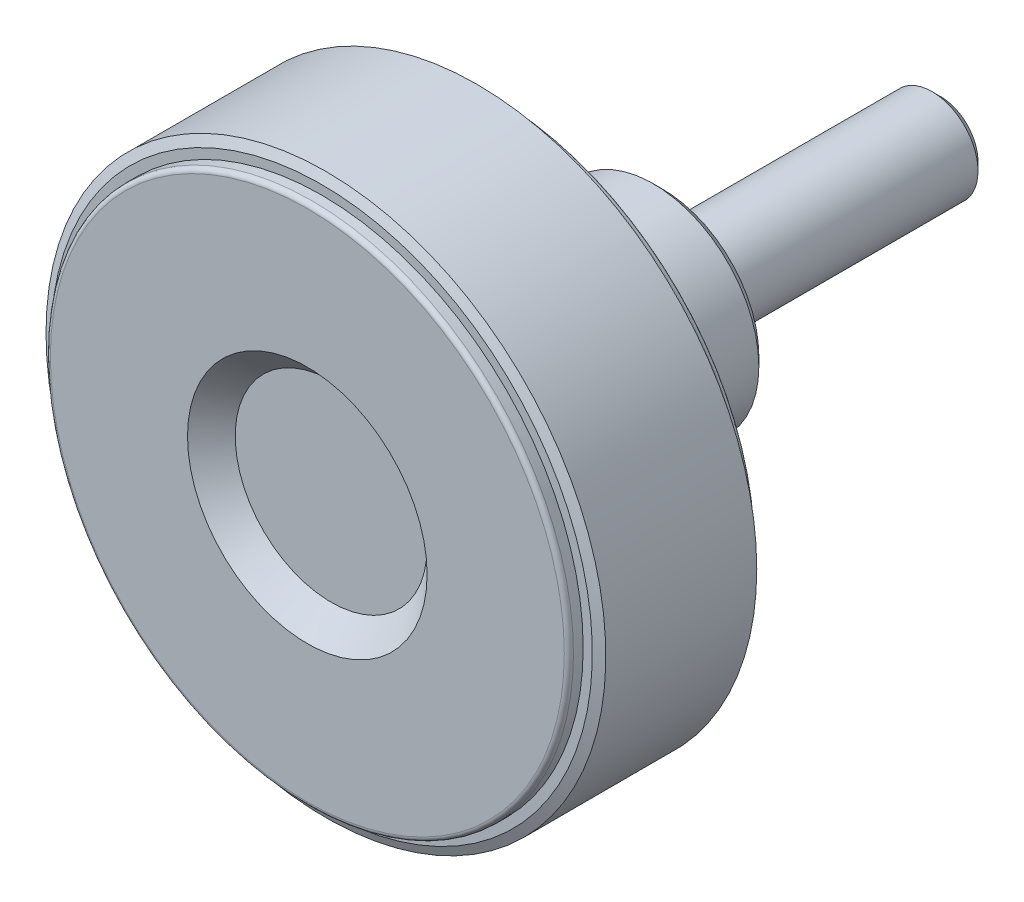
ISO-10303-21;
HEADER;
FILE_DESCRIPTION(('STEP AP214'),'2;1');
FILE_NAME('part.step','',(''),(''),'','','');
FILE_SCHEMA(('AUTOMOTIVE_DESIGN { 1 0 10303 214 1 1 1 1 }'));
ENDSEC;
DATA;
#1=APPLICATION_CONTEXT('core data for automotive mechanical design processes');
#2=APPLICATION_PROTOCOL_DEFINITION('international standard','automotive_design',2000,#1);
#3=PRODUCT_CONTEXT('',#1,'mechanical');
#4=PRODUCT('Part','Part','',(#3));
#5=PRODUCT_RELATED_PRODUCT_CATEGORY('part','',(#4));
#6=PRODUCT_DEFINITION_FORMATION('','',#4);
#7=PRODUCT_DEFINITION_CONTEXT('part definition',#1,'design');
#8=PRODUCT_DEFINITION('design','',#6,#7);
#9=PRODUCT_DEFINITION_SHAPE('','',#8);
#10=(LENGTH_UNIT() NAMED_UNIT(*) SI_UNIT(.MILLI.,.METRE.));
#11=(NAMED_UNIT(*) PLANE_ANGLE_UNIT() SI_UNIT($,.RADIAN.));
#12=(NAMED_UNIT(*) SI_UNIT($,.STERADIAN.) SOLID_ANGLE_UNIT());
#13=UNCERTAINTY_MEASURE_WITH_UNIT(LENGTH_MEASURE(1.E-05),#10,'distance_accuracy_value','');
#14=(GEOMETRIC_REPRESENTATION_CONTEXT(3) GLOBAL_UNCERTAINTY_ASSIGNED_CONTEXT((#13)) GLOBAL_UNIT_ASSIGNED_CONTEXT((#10,
#11,#12)) REPRESENTATION_CONTEXT('',''));
#15=CARTESIAN_POINT('',(0.,0.,0.));
#16=DIRECTION('',(0.,0.,1.));
#17=DIRECTION('',(1.,0.,0.));
#18=AXIS2_PLACEMENT_3D('',#15,#16,#17);
#19=CARTESIAN_POINT('',(0.,0.,-9.04));
#20=DIRECTION('',(0.,0.,1.));
#21=DIRECTION('',(1.,0.,0.));
#22=AXIS2_PLACEMENT_3D('',#19,#20,#21);
#23=CYLINDRICAL_SURFACE('',#22,5.);
#24=CARTESIAN_POINT('',(0.,0.,-29.08));
#25=DIRECTION('',(0.,0.,-1.));
#26=DIRECTION('',(-1.,0.,0.));
#27=AXIS2_PLACEMENT_3D('',#24,#25,#26);
#28=CIRCLE('',#27,5.);
#29=CARTESIAN_POINT('',(-5.,0.,-29.08));
#30=VERTEX_POINT('',#29);
#31=EDGE_CURVE('E9',#30,#30,#28,.F.);
#32=ORIENTED_EDGE('',*,*,#31,.T.);
#33=EDGE_LOOP('',(#32));
#34=FACE_BOUND('',#33,.T.);
#35=CARTESIAN_POINT('',(0.,0.,0.));
#36=DIRECTION('',(0.,0.,1.));
#37=DIRECTION('',(1.,0.,0.));
#38=AXIS2_PLACEMENT_3D('',#35,#36,#37);
#39=CIRCLE('',#38,5.);
#40=CARTESIAN_POINT('',(5.,0.,0.));
#41=VERTEX_POINT('',#40);
#42=EDGE_CURVE('E212',#41,#41,#39,.T.);
#43=ORIENTED_EDGE('',*,*,#42,.F.);
#44=EDGE_LOOP('',(#43));
#45=FACE_BOUND('',#44,.T.);
#46=ADVANCED_FACE('F14',(#34,#45),#23,.T.);
#47=CARTESIAN_POINT('',(0.,3.33333333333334,0.));
#48=DIRECTION('',(0.,0.,-1.));
#49=DIRECTION('',(-1.,0.,0.));
#50=AXIS2_PLACEMENT_3D('',#47,#48,#49);
#51=PLANE('',#50);
#52=CARTESIAN_POINT('',(0.,0.,0.));
#53=DIRECTION('',(0.,0.,1.));
#54=DIRECTION('',(1.,0.,0.));
#55=AXIS2_PLACEMENT_3D('',#52,#53,#54);
#56=CIRCLE('',#55,6.66666666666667);
#57=CARTESIAN_POINT('',(6.66666666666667,0.,0.));
#58=VERTEX_POINT('',#57);
#59=EDGE_CURVE('E209',#58,#58,#56,.T.);
#60=ORIENTED_EDGE('',*,*,#59,.F.);
#61=EDGE_LOOP('',(#60));
#62=FACE_BOUND('',#61,.T.);
#63=ORIENTED_EDGE('',*,*,#42,.T.);
#64=EDGE_LOOP('',(#63));
#65=FACE_BOUND('',#64,.T.);
#66=ADVANCED_FACE('F402',(#62,#65),#51,.T.);
#67=CARTESIAN_POINT('',(0.,0.,0.15));
#68=DIRECTION('',(0.,0.,1.));
#69=DIRECTION('',(1.,0.,0.));
#70=AXIS2_PLACEMENT_3D('',#67,#68,#69);
#71=CYLINDRICAL_SURFACE('',#70,6.66666666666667);
#72=ORIENTED_EDGE('',*,*,#59,.T.);
#73=EDGE_LOOP('',(#72));
#74=FACE_BOUND('',#73,.T.);
#75=CARTESIAN_POINT('',(0.,0.,0.3));
#76=DIRECTION('',(0.,0.,1.));
#77=DIRECTION('',(1.,0.,0.));
#78=AXIS2_PLACEMENT_3D('',#75,#76,#77);
#79=CIRCLE('',#78,6.66666666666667);
#80=CARTESIAN_POINT('',(6.66666666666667,0.,0.3));
#81=VERTEX_POINT('',#80);
#82=EDGE_CURVE('E206',#81,#81,#79,.T.);
#83=ORIENTED_EDGE('',*,*,#82,.F.);
#84=EDGE_LOOP('',(#83));
#85=FACE_BOUND('',#84,.T.);
#86=ADVANCED_FACE('F406',(#74,#85),#71,.T.);
#87=CARTESIAN_POINT('',(0.,8.58333333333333,0.3));
#88=DIRECTION('',(0.,0.,-1.));
#89=DIRECTION('',(-1.,0.,0.));
#90=AXIS2_PLACEMENT_3D('',#87,#88,#89);
#91=PLANE('',#90);
#92=CARTESIAN_POINT('',(0.,0.,0.3));
#93=DIRECTION('',(0.,0.,1.));
#94=DIRECTION('',(1.,0.,0.));
#95=AXIS2_PLACEMENT_3D('',#92,#93,#94);
#96=CIRCLE('',#95,10.5);
#97=CARTESIAN_POINT('',(10.5,0.,0.3));
#98=VERTEX_POINT('',#97);
#99=EDGE_CURVE('E175',#98,#98,#96,.T.);
#100=ORIENTED_EDGE('',*,*,#99,.F.);
#101=EDGE_LOOP('',(#100));
#102=FACE_BOUND('',#101,.T.);
#103=ORIENTED_EDGE('',*,*,#82,.T.);
#104=EDGE_LOOP('',(#103));
#105=FACE_BOUND('',#104,.T.);
#106=ADVANCED_FACE('F413',(#102,#105),#91,.T.);
#107=CARTESIAN_POINT('',(0.,0.,1.3));
#108=DIRECTION('',(0.,0.,1.));
#109=DIRECTION('',(1.,0.,0.));
#110=AXIS2_PLACEMENT_3D('',#107,#108,#109);
#111=CONICAL_SURFACE('',#110,11.5,0.785398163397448);
#112=ORIENTED_EDGE('',*,*,#99,.T.);
#113=EDGE_LOOP('',(#112));
#114=FACE_BOUND('',#113,.T.);
#115=CARTESIAN_POINT('',(0.,0.,1.3));
#116=DIRECTION('',(0.,0.,1.));
#117=DIRECTION('',(1.,0.,0.));
#118=AXIS2_PLACEMENT_3D('',#115,#116,#117);
#119=CIRCLE('',#118,11.5);
#120=CARTESIAN_POINT('',(11.5,0.,1.3));
#121=VERTEX_POINT('',#120);
#122=EDGE_CURVE('E172',#121,#121,#119,.T.);
#123=ORIENTED_EDGE('',*,*,#122,.F.);
#124=EDGE_LOOP('',(#123));
#125=FACE_BOUND('',#124,.T.);
#126=ADVANCED_FACE('F420',(#114,#125),#111,.T.);
#127=CARTESIAN_POINT('',(0.,0.,16.4));
#128=DIRECTION('',(0.,0.,1.));
#129=DIRECTION('',(1.,0.,0.));
#130=AXIS2_PLACEMENT_3D('',#127,#128,#129);
#131=CYLINDRICAL_SURFACE('',#130,11.5);
#132=ORIENTED_EDGE('',*,*,#122,.T.);
#133=EDGE_LOOP('',(#132));
#134=FACE_BOUND('',#133,.T.);
#135=CARTESIAN_POINT('',(0.,0.,31.5));
#136=DIRECTION('',(0.,0.,-1.));
#137=DIRECTION('',(-1.,0.,0.));
#138=AXIS2_PLACEMENT_3D('',#135,#136,#137);
#139=CIRCLE('',#138,11.5);
#140=CARTESIAN_POINT('',(-11.5,0.,31.5));
#141=VERTEX_POINT('',#140);
#142=EDGE_CURVE('E75',#141,#141,#139,.T.);
#143=ORIENTED_EDGE('',*,*,#142,.T.);
#144=EDGE_LOOP('',(#143));
#145=FACE_BOUND('',#144,.T.);
#146=ADVANCED_FACE('F423',(#134,#145),#131,.T.);
#147=CARTESIAN_POINT('',(0.,0.,31.5));
#148=DIRECTION('',(0.,0.,-1.));
#149=DIRECTION('',(-1.,0.,0.));
#150=AXIS2_PLACEMENT_3D('',#147,#148,#149);
#151=TOROIDAL_SURFACE('',#150,12.5,1.);
#152=CARTESIAN_POINT('',(0.,0.,32.5));
#153=DIRECTION('',(0.,0.,-1.));
#154=DIRECTION('',(1.,0.,0.));
#155=AXIS2_PLACEMENT_3D('',#152,#153,#154);
#156=CIRCLE('',#155,12.5);
#157=CARTESIAN_POINT('',(-12.5,0.,32.5));
#158=VERTEX_POINT('',#157);
#159=CARTESIAN_POINT('',(12.5,0.,32.5));
#160=VERTEX_POINT('',#159);
#161=EDGE_CURVE('E68',#158,#160,#156,.F.);
#162=ORIENTED_EDGE('',*,*,#161,.F.);
#163=CARTESIAN_POINT('',(0.,0.,32.5));
#164=DIRECTION('',(0.,0.,-1.));
#165=DIRECTION('',(-1.,0.,0.));
#166=AXIS2_PLACEMENT_3D('',#163,#164,#165);
#167=CIRCLE('',#166,12.5);
#168=CARTESIAN_POINT('',(0.,12.5,32.5));
#169=VERTEX_POINT('',#168);
#170=EDGE_CURVE('E71',#169,#158,#167,.F.);
#171=ORIENTED_EDGE('',*,*,#170,.F.);
#172=CARTESIAN_POINT('',(0.,0.,32.5));
#173=DIRECTION('',(0.,0.,-1.));
#174=DIRECTION('',(0.,1.,0.));
#175=AXIS2_PLACEMENT_3D('',#172,#173,#174);
#176=CIRCLE('',#175,12.5);
#177=EDGE_CURVE('E63',#160,#169,#176,.F.);
#178=ORIENTED_EDGE('',*,*,#177,.F.);
#179=EDGE_LOOP('',(#162,#171,#178));
#180=FACE_BOUND('',#179,.T.);
#181=ORIENTED_EDGE('',*,*,#142,.F.);
#182=EDGE_LOOP('',(#181));
#183=FACE_BOUND('',#182,.T.);
#184=ADVANCED_FACE('F66',(#180,#183),#151,.F.);
#185=CARTESIAN_POINT('',(0.,17.4807692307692,32.5));
#186=DIRECTION('',(0.,0.,-1.));
#187=DIRECTION('',(-1.,0.,0.));
#188=AXIS2_PLACEMENT_3D('',#185,#186,#187);
#189=PLANE('',#188);
#190=CARTESIAN_POINT('',(0.,0.,32.5));
#191=DIRECTION('',(0.,0.,1.));
#192=DIRECTION('',(-1.,0.,0.));
#193=AXIS2_PLACEMENT_3D('',#190,#191,#192);
#194=CIRCLE('',#193,22.4615384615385);
#195=CARTESIAN_POINT('',(22.4615384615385,0.,32.5));
#196=VERTEX_POINT('',#195);
#197=CARTESIAN_POINT('',(-22.4615384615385,0.,32.5));
#198=VERTEX_POINT('',#197);
#199=EDGE_CURVE('E81',#196,#198,#194,.F.);
#200=ORIENTED_EDGE('',*,*,#199,.T.);
#201=CARTESIAN_POINT('',(0.,0.,32.5));
#202=DIRECTION('',(0.,0.,1.));
#203=DIRECTION('',(0.,1.,0.));
#204=AXIS2_PLACEMENT_3D('',#201,#202,#203);
#205=CIRCLE('',#204,22.4615384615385);
#206=CARTESIAN_POINT('',(0.,22.4615384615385,32.5));
#207=VERTEX_POINT('',#206);
#208=EDGE_CURVE('E130',#198,#207,#205,.F.);
#209=ORIENTED_EDGE('',*,*,#208,.T.);
#210=CARTESIAN_POINT('',(0.,0.,32.5));
#211=DIRECTION('',(0.,0.,1.));
#212=DIRECTION('',(1.,0.,0.));
#213=AXIS2_PLACEMENT_3D('',#210,#211,#212);
#214=CIRCLE('',#213,22.4615384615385);
#215=EDGE_CURVE('E143',#207,#196,#214,.F.);
#216=ORIENTED_EDGE('',*,*,#215,.T.);
#217=EDGE_LOOP('',(#200,#209,#216));
#218=FACE_BOUND('',#217,.T.);
#219=ORIENTED_EDGE('',*,*,#170,.T.);
#220=ORIENTED_EDGE('',*,*,#161,.T.);
#221=ORIENTED_EDGE('',*,*,#177,.T.);
#222=EDGE_LOOP('',(#219,#220,#221));
#223=FACE_BOUND('',#222,.T.);
#224=ADVANCED_FACE('F79',(#218,#223),#189,.T.);
#225=CARTESIAN_POINT('',(0.,0.,31.5));
#226=DIRECTION('',(0.,0.,-1.));
#227=DIRECTION('',(-1.,0.,0.));
#228=AXIS2_PLACEMENT_3D('',#225,#226,#227);
#229=TOROIDAL_SURFACE('',#228,22.4615384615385,1.);
#230=ORIENTED_EDGE('',*,*,#208,.F.);
#231=ORIENTED_EDGE('',*,*,#199,.F.);
#232=ORIENTED_EDGE('',*,*,#215,.F.);
#233=EDGE_LOOP('',(#230,#231,#232));
#234=FACE_BOUND('',#233,.T.);
#235=CARTESIAN_POINT('',(0.,0.,31.5));
#236=DIRECTION('',(0.,0.,1.));
#237=DIRECTION('',(1.,0.,0.));
#238=AXIS2_PLACEMENT_3D('',#235,#236,#237);
#239=CIRCLE('',#238,23.4615384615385);
#240=CARTESIAN_POINT('',(23.4615384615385,0.,31.5));
#241=VERTEX_POINT('',#240);
#242=EDGE_CURVE('E203',#241,#241,#239,.F.);
#243=ORIENTED_EDGE('',*,*,#242,.T.);
#244=EDGE_LOOP('',(#243));
#245=FACE_BOUND('',#244,.T.);
#246=ADVANCED_FACE('F100',(#234,#245),#229,.F.);
#247=CARTESIAN_POINT('',(0.,0.,25.));
#248=DIRECTION('',(0.,0.,1.));
#249=DIRECTION('',(1.,0.,0.));
#250=AXIS2_PLACEMENT_3D('',#247,#248,#249);
#251=CYLINDRICAL_SURFACE('',#250,23.4615384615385);
#252=ORIENTED_EDGE('',*,*,#242,.F.);
#253=EDGE_LOOP('',(#252));
#254=FACE_BOUND('',#253,.T.);
#255=CARTESIAN_POINT('',(0.,0.,18.5));
#256=DIRECTION('',(0.,0.,1.));
#257=DIRECTION('',(1.,0.,0.));
#258=AXIS2_PLACEMENT_3D('',#255,#256,#257);
#259=CIRCLE('',#258,23.4615384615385);
#260=CARTESIAN_POINT('',(23.4615384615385,0.,18.5));
#261=VERTEX_POINT('',#260);
#262=EDGE_CURVE('E199',#261,#261,#259,.T.);
#263=ORIENTED_EDGE('',*,*,#262,.F.);
#264=EDGE_LOOP('',(#263));
#265=FACE_BOUND('',#264,.T.);
#266=ADVANCED_FACE('F326',(#254,#265),#251,.F.);
#267=CARTESIAN_POINT('',(0.,25.7307692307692,18.5));
#268=DIRECTION('',(0.,0.,-1.));
#269=DIRECTION('',(-1.,0.,0.));
#270=AXIS2_PLACEMENT_3D('',#267,#268,#269);
#271=PLANE('',#270);
#272=CARTESIAN_POINT('',(0.,0.,18.5));
#273=DIRECTION('',(0.,0.,1.));
#274=DIRECTION('',(-1.,0.,0.));
#275=AXIS2_PLACEMENT_3D('',#272,#273,#274);
#276=CIRCLE('',#275,28.);
#277=CARTESIAN_POINT('',(-28.,0.,18.5));
#278=VERTEX_POINT('',#277);
#279=CARTESIAN_POINT('',(28.,0.,18.5));
#280=VERTEX_POINT('',#279);
#281=EDGE_CURVE('E261',#278,#280,#276,.T.);
#282=ORIENTED_EDGE('',*,*,#281,.F.);
#283=CARTESIAN_POINT('',(0.,0.,18.5));
#284=DIRECTION('',(0.,0.,1.));
#285=DIRECTION('',(0.,1.,0.));
#286=AXIS2_PLACEMENT_3D('',#283,#284,#285);
#287=CIRCLE('',#286,28.);
#288=CARTESIAN_POINT('',(0.,28.,18.5));
#289=VERTEX_POINT('',#288);
#290=EDGE_CURVE('E296',#289,#278,#287,.T.);
#291=ORIENTED_EDGE('',*,*,#290,.F.);
#292=CARTESIAN_POINT('',(0.,0.,18.5));
#293=DIRECTION('',(0.,0.,1.));
#294=DIRECTION('',(1.,0.,0.));
#295=AXIS2_PLACEMENT_3D('',#292,#293,#294);
#296=CIRCLE('',#295,28.);
#297=EDGE_CURVE('E202',#280,#289,#296,.T.);
#298=ORIENTED_EDGE('',*,*,#297,.F.);
#299=EDGE_LOOP('',(#282,#291,#298));
#300=FACE_BOUND('',#299,.T.);
#301=ORIENTED_EDGE('',*,*,#262,.T.);
#302=EDGE_LOOP('',(#301));
#303=FACE_BOUND('',#302,.T.);
#304=ADVANCED_FACE('F272',(#300,#303),#271,.T.);
#305=CARTESIAN_POINT('',(0.,0.,19.));
#306=DIRECTION('',(0.,0.,-1.));
#307=DIRECTION('',(-1.,0.,0.));
#308=AXIS2_PLACEMENT_3D('',#305,#306,#307);
#309=TOROIDAL_SURFACE('',#308,28.,0.5);
#310=ORIENTED_EDGE('',*,*,#290,.T.);
#311=ORIENTED_EDGE('',*,*,#281,.T.);
#312=ORIENTED_EDGE('',*,*,#297,.T.);
#313=EDGE_LOOP('',(#310,#311,#312));
#314=FACE_BOUND('',#313,.T.);
#315=CARTESIAN_POINT('',(0.,0.,19.));
#316=DIRECTION('',(0.,0.,1.));
#317=DIRECTION('',(1.,0.,0.));
#318=AXIS2_PLACEMENT_3D('',#315,#316,#317);
#319=CIRCLE('',#318,28.5);
#320=CARTESIAN_POINT('',(28.5,0.,19.));
#321=VERTEX_POINT('',#320);
#322=EDGE_CURVE('E198',#321,#321,#319,.T.);
#323=ORIENTED_EDGE('',*,*,#322,.F.);
#324=EDGE_LOOP('',(#323));
#325=FACE_BOUND('',#324,.T.);
#326=ADVANCED_FACE('F266',(#314,#325),#309,.T.);
#327=CARTESIAN_POINT('',(0.,0.,19.53));
#328=DIRECTION('',(0.,0.,1.));
#329=DIRECTION('',(1.,0.,0.));
#330=AXIS2_PLACEMENT_3D('',#327,#328,#329);
#331=CYLINDRICAL_SURFACE('',#330,28.5);
#332=ORIENTED_EDGE('',*,*,#322,.T.);
#333=EDGE_LOOP('',(#332));
#334=FACE_BOUND('',#333,.T.);
#335=CARTESIAN_POINT('',(0.,0.,20.06));
#336=DIRECTION('',(0.,0.,1.));
#337=DIRECTION('',(1.,0.,0.));
#338=AXIS2_PLACEMENT_3D('',#335,#336,#337);
#339=CIRCLE('',#338,28.5);
#340=CARTESIAN_POINT('',(28.5,0.,20.06));
#341=VERTEX_POINT('',#340);
#342=EDGE_CURVE('E195',#341,#341,#339,.T.);
#343=ORIENTED_EDGE('',*,*,#342,.F.);
#344=EDGE_LOOP('',(#343));
#345=FACE_BOUND('',#344,.T.);
#346=ADVANCED_FACE('F271',(#334,#345),#331,.T.);
#347=CARTESIAN_POINT('',(0.,29.,20.06));
#348=DIRECTION('',(0.,0.,-1.));
#349=DIRECTION('',(-1.,0.,0.));
#350=AXIS2_PLACEMENT_3D('',#347,#348,#349);
#351=PLANE('',#350);
#352=CARTESIAN_POINT('',(0.,0.,20.06));
#353=DIRECTION('',(0.,0.,1.));
#354=DIRECTION('',(1.,0.,0.));
#355=AXIS2_PLACEMENT_3D('',#352,#353,#354);
#356=CIRCLE('',#355,29.5);
#357=CARTESIAN_POINT('',(29.5,0.,20.06));
#358=VERTEX_POINT('',#357);
#359=EDGE_CURVE('E191',#358,#358,#356,.T.);
#360=ORIENTED_EDGE('',*,*,#359,.F.);
#361=EDGE_LOOP('',(#360));
#362=FACE_BOUND('',#361,.T.);
#363=ORIENTED_EDGE('',*,*,#342,.T.);
#364=EDGE_LOOP('',(#363));
#365=FACE_BOUND('',#364,.T.);
#366=ADVANCED_FACE('F339',(#362,#365),#351,.T.);
#367=CARTESIAN_POINT('',(0.,0.,20.526307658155));
#368=DIRECTION('',(0.,0.,1.));
#369=DIRECTION('',(1.,0.,0.));
#370=AXIS2_PLACEMENT_3D('',#367,#368,#369);
#371=CONICAL_SURFACE('',#370,30.5,1.13446401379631);
#372=CARTESIAN_POINT('',(-1.81188397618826E-13,-3.78364006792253E-12,20.526307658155));
#373=DIRECTION('',(0.,0.,-1.));
#374=DIRECTION('',(-1.,0.,0.));
#375=AXIS2_PLACEMENT_3D('',#372,#373,#374);
#376=CIRCLE('',#375,30.5000000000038);
#377=CARTESIAN_POINT('',(-30.500000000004,-3.78364006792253E-12,20.526307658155));
#378=VERTEX_POINT('',#377);
#379=EDGE_CURVE('E194',#378,#378,#376,.F.);
#380=ORIENTED_EDGE('',*,*,#379,.F.);
#381=EDGE_LOOP('',(#380));
#382=FACE_BOUND('',#381,.T.);
#383=ORIENTED_EDGE('',*,*,#359,.T.);
#384=EDGE_LOOP('',(#383));
#385=FACE_BOUND('',#384,.T.);
#386=ADVANCED_FACE('F337',(#382,#385),#371,.T.);
#387=CARTESIAN_POINT('',(0.,5.22727272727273,36.4));
#388=DIRECTION('',(0.,0.,1.));
#389=DIRECTION('',(1.,0.,0.));
#390=AXIS2_PLACEMENT_3D('',#387,#388,#389);
#391=PLANE('',#390);
#392=CARTESIAN_POINT('',(0.,0.,36.4));
#393=DIRECTION('',(0.,0.,1.));
#394=DIRECTION('',(1.,0.,0.));
#395=AXIS2_PLACEMENT_3D('',#392,#393,#394);
#396=CIRCLE('',#395,10.4545454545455);
#397=CARTESIAN_POINT('',(10.4545454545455,0.,36.4));
#398=VERTEX_POINT('',#397);
#399=EDGE_CURVE('E179',#398,#398,#396,.T.);
#400=ORIENTED_EDGE('',*,*,#399,.T.);
#401=EDGE_LOOP('',(#400));
#402=FACE_BOUND('',#401,.T.);
#403=ADVANCED_FACE('F239',(#402),#391,.T.);
#404=CARTESIAN_POINT('',(0.,0.,39.));
#405=DIRECTION('',(0.,0.,1.));
#406=DIRECTION('',(1.,0.,0.));
#407=AXIS2_PLACEMENT_3D('',#404,#405,#406);
#408=CONICAL_SURFACE('',#407,13.0545454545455,0.785398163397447);
#409=CARTESIAN_POINT('',(0.,0.,39.));
#410=DIRECTION('',(0.,0.,1.));
#411=DIRECTION('',(1.,0.,0.));
#412=AXIS2_PLACEMENT_3D('',#409,#410,#411);
#413=CIRCLE('',#412,13.0545454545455);
#414=CARTESIAN_POINT('',(13.0545454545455,0.,39.));
#415=VERTEX_POINT('',#414);
#416=EDGE_CURVE('E176',#415,#415,#413,.F.);
#417=ORIENTED_EDGE('',*,*,#416,.F.);
#418=EDGE_LOOP('',(#417));
#419=FACE_BOUND('',#418,.T.);
#420=ORIENTED_EDGE('',*,*,#399,.F.);
#421=EDGE_LOOP('',(#420));
#422=FACE_BOUND('',#421,.T.);
#423=ADVANCED_FACE('F237',(#419,#422),#408,.F.);
#424=CARTESIAN_POINT('',(0.,20.5272727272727,39.));
#425=DIRECTION('',(0.,0.,1.));
#426=DIRECTION('',(1.,0.,0.));
#427=AXIS2_PLACEMENT_3D('',#424,#425,#426);
#428=PLANE('',#427);
#429=ORIENTED_EDGE('',*,*,#416,.T.);
#430=EDGE_LOOP('',(#429));
#431=FACE_BOUND('',#430,.T.);
#432=CARTESIAN_POINT('',(0.,0.,39.));
#433=DIRECTION('',(0.,0.,-1.));
#434=DIRECTION('',(-1.,0.,0.));
#435=AXIS2_PLACEMENT_3D('',#432,#433,#434);
#436=CIRCLE('',#435,28.);
#437=CARTESIAN_POINT('',(0.,28.,39.));
#438=VERTEX_POINT('',#437);
#439=CARTESIAN_POINT('',(-28.,0.,39.));
#440=VERTEX_POINT('',#439);
#441=EDGE_CURVE('E216',#438,#440,#436,.F.);
#442=ORIENTED_EDGE('',*,*,#441,.T.);
#443=CARTESIAN_POINT('',(0.,0.,39.));
#444=DIRECTION('',(0.,0.,-1.));
#445=DIRECTION('',(1.,0.,0.));
#446=AXIS2_PLACEMENT_3D('',#443,#444,#445);
#447=CIRCLE('',#446,28.);
#448=CARTESIAN_POINT('',(28.,0.,39.));
#449=VERTEX_POINT('',#448);
#450=EDGE_CURVE('E31',#440,#449,#447,.F.);
#451=ORIENTED_EDGE('',*,*,#450,.T.);
#452=CARTESIAN_POINT('',(0.,0.,39.));
#453=DIRECTION('',(0.,0.,-1.));
#454=DIRECTION('',(0.,1.,0.));
#455=AXIS2_PLACEMENT_3D('',#452,#453,#454);
#456=CIRCLE('',#455,28.);
#457=EDGE_CURVE('E182',#449,#438,#456,.F.);
#458=ORIENTED_EDGE('',*,*,#457,.T.);
#459=EDGE_LOOP('',(#442,#451,#458));
#460=FACE_BOUND('',#459,.T.);
#461=ADVANCED_FACE('F235',(#431,#460),#428,.T.);
#462=CARTESIAN_POINT('',(0.,0.,38.5));
#463=DIRECTION('',(0.,0.,-1.));
#464=DIRECTION('',(-1.,0.,0.));
#465=AXIS2_PLACEMENT_3D('',#462,#463,#464);
#466=TOROIDAL_SURFACE('',#465,28.,0.5);
#467=CARTESIAN_POINT('',(0.,0.,38.5));
#468=DIRECTION('',(0.,0.,-1.));
#469=DIRECTION('',(-1.,0.,0.));
#470=AXIS2_PLACEMENT_3D('',#467,#468,#469);
#471=CIRCLE('',#470,28.5);
#472=CARTESIAN_POINT('',(-28.5,0.,38.5));
#473=VERTEX_POINT('',#472);
#474=EDGE_CURVE('E183',#473,#473,#471,.F.);
#475=ORIENTED_EDGE('',*,*,#474,.T.);
#476=EDGE_LOOP('',(#475));
#477=FACE_BOUND('',#476,.T.);
#478=ORIENTED_EDGE('',*,*,#450,.F.);
#479=ORIENTED_EDGE('',*,*,#441,.F.);
#480=ORIENTED_EDGE('',*,*,#457,.F.);
#481=EDGE_LOOP('',(#478,#479,#480));
#482=FACE_BOUND('',#481,.T.);
#483=ADVANCED_FACE('F223',(#477,#482),#466,.T.);
#484=CARTESIAN_POINT('',(0.,0.,37.97));
#485=DIRECTION('',(0.,0.,1.));
#486=DIRECTION('',(1.,0.,0.));
#487=AXIS2_PLACEMENT_3D('',#484,#485,#486);
#488=CYLINDRICAL_SURFACE('',#487,28.5);
#489=ORIENTED_EDGE('',*,*,#474,.F.);
#490=EDGE_LOOP('',(#489));
#491=FACE_BOUND('',#490,.T.);
#492=CARTESIAN_POINT('',(0.,0.,37.44));
#493=DIRECTION('',(0.,0.,1.));
#494=DIRECTION('',(1.,0.,0.));
#495=AXIS2_PLACEMENT_3D('',#492,#493,#494);
#496=CIRCLE('',#495,28.5);
#497=CARTESIAN_POINT('',(28.5,0.,37.44));
#498=VERTEX_POINT('',#497);
#499=EDGE_CURVE('E184',#498,#498,#496,.T.);
#500=ORIENTED_EDGE('',*,*,#499,.T.);
#501=EDGE_LOOP('',(#500));
#502=FACE_BOUND('',#501,.T.);
#503=ADVANCED_FACE('F234',(#491,#502),#488,.T.);
#504=CARTESIAN_POINT('',(0.,0.,36.973692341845));
#505=DIRECTION('',(0.,0.,-1.));
#506=DIRECTION('',(-1.,0.,0.));
#507=AXIS2_PLACEMENT_3D('',#504,#505,#506);
#508=CONICAL_SURFACE('',#507,30.5,1.13446401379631);
#509=CARTESIAN_POINT('',(0.,0.,37.44));
#510=DIRECTION('',(0.,0.,-1.));
#511=DIRECTION('',(-1.,0.,0.));
#512=AXIS2_PLACEMENT_3D('',#509,#510,#511);
#513=CIRCLE('',#512,29.5);
#514=CARTESIAN_POINT('',(-29.5,0.,37.44));
#515=VERTEX_POINT('',#514);
#516=EDGE_CURVE('E187',#515,#515,#513,.F.);
#517=ORIENTED_EDGE('',*,*,#516,.F.);
#518=EDGE_LOOP('',(#517));
#519=FACE_BOUND('',#518,.T.);
#520=CARTESIAN_POINT('',(0.,0.,36.973692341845));
#521=DIRECTION('',(0.,0.,-1.));
#522=DIRECTION('',(0.,1.,0.));
#523=AXIS2_PLACEMENT_3D('',#520,#521,#522);
#524=CIRCLE('',#523,30.5);
#525=CARTESIAN_POINT('',(0.,30.5,36.973692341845));
#526=VERTEX_POINT('',#525);
#527=EDGE_CURVE('E190',#526,#526,#524,.F.);
#528=ORIENTED_EDGE('',*,*,#527,.T.);
#529=EDGE_LOOP('',(#528));
#530=FACE_BOUND('',#529,.T.);
#531=ADVANCED_FACE('F358',(#519,#530),#508,.T.);
#532=CARTESIAN_POINT('',(0.,29.,37.44));
#533=DIRECTION('',(0.,0.,1.));
#534=DIRECTION('',(1.,0.,0.));
#535=AXIS2_PLACEMENT_3D('',#532,#533,#534);
#536=PLANE('',#535);
#537=ORIENTED_EDGE('',*,*,#499,.F.);
#538=EDGE_LOOP('',(#537));
#539=FACE_BOUND('',#538,.T.);
#540=ORIENTED_EDGE('',*,*,#516,.T.);
#541=EDGE_LOOP('',(#540));
#542=FACE_BOUND('',#541,.T.);
#543=ADVANCED_FACE('F356',(#539,#542),#536,.T.);
#544=CARTESIAN_POINT('',(-1.81188397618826E-13,-3.78364006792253E-12,0.));
#545=DIRECTION('',(0.,0.,-1.));
#546=DIRECTION('',(-1.,0.,0.));
#547=AXIS2_PLACEMENT_3D('',#544,#545,#546);
#548=CYLINDRICAL_SURFACE('',#547,30.5000000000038);
#549=ORIENTED_EDGE('',*,*,#379,.T.);
#550=EDGE_LOOP('',(#549));
#551=FACE_BOUND('',#550,.T.);
#552=ORIENTED_EDGE('',*,*,#527,.F.);
#553=EDGE_LOOP('',(#552));
#554=FACE_BOUND('',#553,.T.);
#555=ADVANCED_FACE('F352',(#551,#554),#548,.T.);
#556=CARTESIAN_POINT('',(0.,0.,-30.));
#557=DIRECTION('',(0.,0.,-1.));
#558=DIRECTION('',(-1.,0.,0.));
#559=AXIS2_PLACEMENT_3D('',#556,#557,#558);
#560=PLANE('',#559);
#561=CARTESIAN_POINT('',(0.,0.,-30.));
#562=DIRECTION('',(0.,0.,-1.));
#563=DIRECTION('',(-1.,0.,0.));
#564=AXIS2_PLACEMENT_3D('',#561,#562,#563);
#565=CIRCLE('',#564,4.08);
#566=CARTESIAN_POINT('',(-4.08,0.,-30.));
#567=VERTEX_POINT('',#566);
#568=EDGE_CURVE('E23',#567,#567,#565,.T.);
#569=ORIENTED_EDGE('',*,*,#568,.T.);
#570=EDGE_LOOP('',(#569));
#571=FACE_BOUND('',#570,.T.);
#572=ADVANCED_FACE('F355',(#571),#560,.T.);
#573=CARTESIAN_POINT('',(0.,0.,-30.));
#574=DIRECTION('',(0.,0.,1.));
#575=DIRECTION('',(1.,0.,0.));
#576=AXIS2_PLACEMENT_3D('',#573,#574,#575);
#577=CONICAL_SURFACE('',#576,4.08,0.785398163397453);
#578=ORIENTED_EDGE('',*,*,#31,.F.);
#579=EDGE_LOOP('',(#578));
#580=FACE_BOUND('',#579,.T.);
#581=ORIENTED_EDGE('',*,*,#568,.F.);
#582=EDGE_LOOP('',(#581));
#583=FACE_BOUND('',#582,.T.);
#584=ADVANCED_FACE('F16',(#580,#583),#577,.T.);
#585=CLOSED_SHELL('',(#46,#66,#86,#106,#126,#146,#184,#224,#246,#266,#304,#326,#346,#366,#386,
#403,#423,#461,#483,#503,#531,#543,#555,#572,#584));
#586=MANIFOLD_SOLID_BREP('B1',#585);
#587=ADVANCED_BREP_SHAPE_REPRESENTATION('',(#18,#586),#14);
#588=SHAPE_DEFINITION_REPRESENTATION(#9,#587);
ENDSEC;
END-ISO-10303-21;
